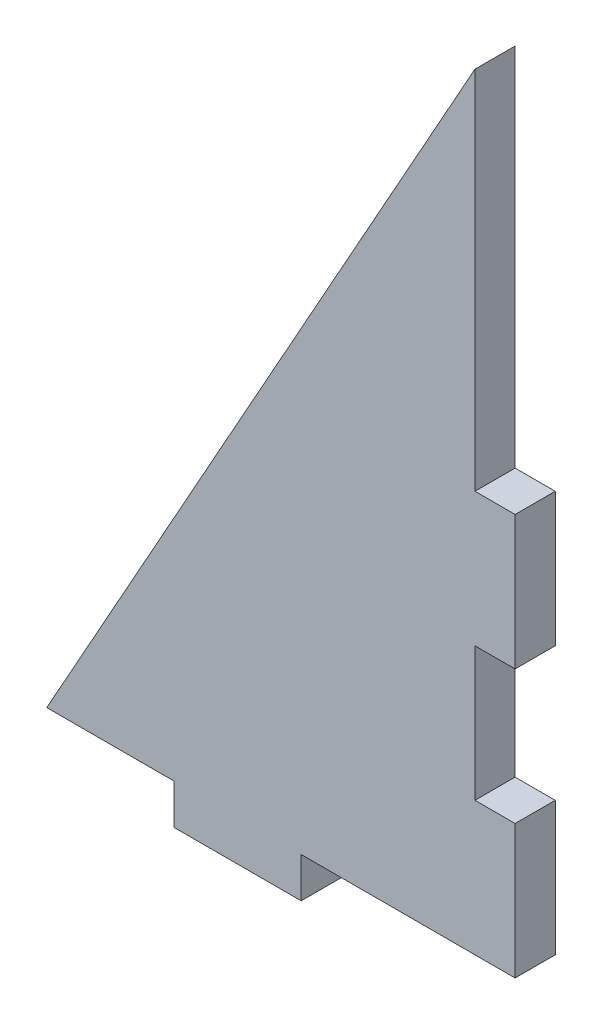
ISO-10303-21;
HEADER;
FILE_DESCRIPTION(('STEP AP214'),'2;1');
FILE_NAME('part.step','',(''),(''),'','','');
FILE_SCHEMA(('AUTOMOTIVE_DESIGN { 1 0 10303 214 1 1 1 1 }'));
ENDSEC;
DATA;
#1=APPLICATION_CONTEXT('core data for automotive mechanical design processes');
#2=APPLICATION_PROTOCOL_DEFINITION('international standard','automotive_design',2000,#1);
#3=PRODUCT_CONTEXT('',#1,'mechanical');
#4=PRODUCT('Part','Part','',(#3));
#5=PRODUCT_RELATED_PRODUCT_CATEGORY('part','',(#4));
#6=PRODUCT_DEFINITION_FORMATION('','',#4);
#7=PRODUCT_DEFINITION_CONTEXT('part definition',#1,'design');
#8=PRODUCT_DEFINITION('design','',#6,#7);
#9=PRODUCT_DEFINITION_SHAPE('','',#8);
#10=(LENGTH_UNIT() NAMED_UNIT(*) SI_UNIT(.MILLI.,.METRE.));
#11=(NAMED_UNIT(*) PLANE_ANGLE_UNIT() SI_UNIT($,.RADIAN.));
#12=(NAMED_UNIT(*) SI_UNIT($,.STERADIAN.) SOLID_ANGLE_UNIT());
#13=UNCERTAINTY_MEASURE_WITH_UNIT(LENGTH_MEASURE(1.E-05),#10,'distance_accuracy_value','');
#14=(GEOMETRIC_REPRESENTATION_CONTEXT(3) GLOBAL_UNCERTAINTY_ASSIGNED_CONTEXT((#13)) GLOBAL_UNIT_ASSIGNED_CONTEXT((#10,
#11,#12)) REPRESENTATION_CONTEXT('',''));
#15=CARTESIAN_POINT('',(0.,0.,0.));
#16=DIRECTION('',(0.,0.,1.));
#17=DIRECTION('',(1.,0.,0.));
#18=AXIS2_PLACEMENT_3D('',#15,#16,#17);
#19=CARTESIAN_POINT('',(0.,40.3163641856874,3.));
#20=DIRECTION('',(0.873136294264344,-0.487476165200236,0.));
#21=DIRECTION('',(0.487476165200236,0.873136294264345,0.));
#22=AXIS2_PLACEMENT_3D('',#19,#20,#21);
#23=PLANE('',#22);
#24=DIRECTION('',(-0.487476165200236,-0.873136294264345,0.));
#25=VECTOR('',#24,1.);
#26=CARTESIAN_POINT('',(0.,40.3163641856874,0.));
#27=LINE('',#26,#25);
#28=CARTESIAN_POINT('',(0.,40.3163641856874,0.));
#29=VERTEX_POINT('',#28);
#30=CARTESIAN_POINT('',(-32.,-17.,0.));
#31=VERTEX_POINT('',#30);
#32=EDGE_CURVE('E159',#29,#31,#27,.T.);
#33=ORIENTED_EDGE('',*,*,#32,.T.);
#34=DIRECTION('',(0.,0.,-1.));
#35=VECTOR('',#34,1.);
#36=CARTESIAN_POINT('',(-32.,-17.,3.));
#37=LINE('',#36,#35);
#38=CARTESIAN_POINT('',(-32.,-17.,3.));
#39=VERTEX_POINT('',#38);
#40=EDGE_CURVE('E11',#39,#31,#37,.T.);
#41=ORIENTED_EDGE('',*,*,#40,.F.);
#42=DIRECTION('',(-0.487476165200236,-0.873136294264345,0.));
#43=VECTOR('',#42,1.);
#44=CARTESIAN_POINT('',(0.,40.3163641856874,3.));
#45=LINE('',#44,#43);
#46=CARTESIAN_POINT('',(0.,40.3163641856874,3.));
#47=VERTEX_POINT('',#46);
#48=EDGE_CURVE('E184',#47,#39,#45,.T.);
#49=ORIENTED_EDGE('',*,*,#48,.F.);
#50=DIRECTION('',(0.,0.,-1.));
#51=VECTOR('',#50,1.);
#52=CARTESIAN_POINT('',(0.,40.3163641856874,3.));
#53=LINE('',#52,#51);
#54=EDGE_CURVE('E155',#47,#29,#53,.T.);
#55=ORIENTED_EDGE('',*,*,#54,.T.);
#56=EDGE_LOOP('',(#33,#41,#49,#55));
#57=FACE_BOUND('',#56,.T.);
#58=ADVANCED_FACE('F33',(#57),#23,.F.);
#59=CARTESIAN_POINT('',(-32.,-17.,3.));
#60=DIRECTION('',(0.,1.,0.));
#61=DIRECTION('',(0.,0.,1.));
#62=AXIS2_PLACEMENT_3D('',#59,#60,#61);
#63=PLANE('',#62);
#64=DIRECTION('',(1.,0.,0.));
#65=VECTOR('',#64,1.);
#66=CARTESIAN_POINT('',(-32.,-17.,0.));
#67=LINE('',#66,#65);
#68=CARTESIAN_POINT('',(-22.4928481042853,-17.,0.));
#69=VERTEX_POINT('',#68);
#70=EDGE_CURVE('E162',#31,#69,#67,.T.);
#71=ORIENTED_EDGE('',*,*,#70,.T.);
#72=DIRECTION('',(0.,0.,-1.));
#73=VECTOR('',#72,1.);
#74=CARTESIAN_POINT('',(-22.4928481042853,-17.,3.));
#75=LINE('',#74,#73);
#76=CARTESIAN_POINT('',(-22.4928481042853,-17.,3.));
#77=VERTEX_POINT('',#76);
#78=EDGE_CURVE('E41',#77,#69,#75,.T.);
#79=ORIENTED_EDGE('',*,*,#78,.F.);
#80=DIRECTION('',(1.,0.,0.));
#81=VECTOR('',#80,1.);
#82=CARTESIAN_POINT('',(-32.,-17.,3.));
#83=LINE('',#82,#81);
#84=EDGE_CURVE('E107',#39,#77,#83,.T.);
#85=ORIENTED_EDGE('',*,*,#84,.F.);
#86=ORIENTED_EDGE('',*,*,#40,.T.);
#87=EDGE_LOOP('',(#71,#79,#85,#86));
#88=FACE_BOUND('',#87,.T.);
#89=ADVANCED_FACE('F266',(#88),#63,.F.);
#90=CARTESIAN_POINT('',(-22.4928481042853,-17.,3.));
#91=DIRECTION('',(1.,0.,0.));
#92=DIRECTION('',(0.,0.,-1.));
#93=AXIS2_PLACEMENT_3D('',#90,#91,#92);
#94=PLANE('',#93);
#95=DIRECTION('',(0.,-1.,0.));
#96=VECTOR('',#95,1.);
#97=CARTESIAN_POINT('',(-22.4928481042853,-17.,0.));
#98=LINE('',#97,#96);
#99=CARTESIAN_POINT('',(-22.4928481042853,-20.,0.));
#100=VERTEX_POINT('',#99);
#101=EDGE_CURVE('E164',#69,#100,#98,.T.);
#102=ORIENTED_EDGE('',*,*,#101,.T.);
#103=DIRECTION('',(0.,0.,-1.));
#104=VECTOR('',#103,1.);
#105=CARTESIAN_POINT('',(-22.4928481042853,-20.,3.));
#106=LINE('',#105,#104);
#107=CARTESIAN_POINT('',(-22.4928481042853,-20.,3.));
#108=VERTEX_POINT('',#107);
#109=EDGE_CURVE('E206',#108,#100,#106,.T.);
#110=ORIENTED_EDGE('',*,*,#109,.F.);
#111=DIRECTION('',(0.,-1.,0.));
#112=VECTOR('',#111,1.);
#113=CARTESIAN_POINT('',(-22.4928481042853,-17.,3.));
#114=LINE('',#113,#112);
#115=EDGE_CURVE('E214',#77,#108,#114,.T.);
#116=ORIENTED_EDGE('',*,*,#115,.F.);
#117=ORIENTED_EDGE('',*,*,#78,.T.);
#118=EDGE_LOOP('',(#102,#110,#116,#117));
#119=FACE_BOUND('',#118,.T.);
#120=ADVANCED_FACE('F212',(#119),#94,.F.);
#121=CARTESIAN_POINT('',(-22.4928481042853,-20.,3.));
#122=DIRECTION('',(0.,1.,0.));
#123=DIRECTION('',(0.,0.,1.));
#124=AXIS2_PLACEMENT_3D('',#121,#122,#123);
#125=PLANE('',#124);
#126=DIRECTION('',(1.,0.,0.));
#127=VECTOR('',#126,1.);
#128=CARTESIAN_POINT('',(-22.4928481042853,-20.,0.));
#129=LINE('',#128,#127);
#130=CARTESIAN_POINT('',(-12.9860055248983,-20.,0.));
#131=VERTEX_POINT('',#130);
#132=EDGE_CURVE('E166',#100,#131,#129,.T.);
#133=ORIENTED_EDGE('',*,*,#132,.T.);
#134=DIRECTION('',(0.,0.,-1.));
#135=VECTOR('',#134,1.);
#136=CARTESIAN_POINT('',(-12.9860055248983,-20.,3.));
#137=LINE('',#136,#135);
#138=CARTESIAN_POINT('',(-12.9860055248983,-20.,3.));
#139=VERTEX_POINT('',#138);
#140=EDGE_CURVE('E203',#139,#131,#137,.T.);
#141=ORIENTED_EDGE('',*,*,#140,.F.);
#142=DIRECTION('',(1.,0.,0.));
#143=VECTOR('',#142,1.);
#144=CARTESIAN_POINT('',(-22.4928481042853,-20.,3.));
#145=LINE('',#144,#143);
#146=EDGE_CURVE('E231',#108,#139,#145,.T.);
#147=ORIENTED_EDGE('',*,*,#146,.F.);
#148=ORIENTED_EDGE('',*,*,#109,.T.);
#149=EDGE_LOOP('',(#133,#141,#147,#148));
#150=FACE_BOUND('',#149,.T.);
#151=ADVANCED_FACE('F222',(#150),#125,.F.);
#152=CARTESIAN_POINT('',(-12.9860055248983,-20.,3.));
#153=DIRECTION('',(-1.,0.,0.));
#154=DIRECTION('',(0.,0.,1.));
#155=AXIS2_PLACEMENT_3D('',#152,#153,#154);
#156=PLANE('',#155);
#157=DIRECTION('',(0.,1.,0.));
#158=VECTOR('',#157,1.);
#159=CARTESIAN_POINT('',(-12.9860055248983,-20.,0.));
#160=LINE('',#159,#158);
#161=CARTESIAN_POINT('',(-12.9860055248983,-17.,0.));
#162=VERTEX_POINT('',#161);
#163=EDGE_CURVE('E168',#131,#162,#160,.T.);
#164=ORIENTED_EDGE('',*,*,#163,.T.);
#165=DIRECTION('',(0.,0.,-1.));
#166=VECTOR('',#165,1.);
#167=CARTESIAN_POINT('',(-12.9860055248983,-17.,3.));
#168=LINE('',#167,#166);
#169=CARTESIAN_POINT('',(-12.9860055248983,-17.,3.));
#170=VERTEX_POINT('',#169);
#171=EDGE_CURVE('E200',#170,#162,#168,.T.);
#172=ORIENTED_EDGE('',*,*,#171,.F.);
#173=DIRECTION('',(0.,1.,0.));
#174=VECTOR('',#173,1.);
#175=CARTESIAN_POINT('',(-12.9860055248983,-20.,3.));
#176=LINE('',#175,#174);
#177=EDGE_CURVE('E228',#139,#170,#176,.T.);
#178=ORIENTED_EDGE('',*,*,#177,.F.);
#179=ORIENTED_EDGE('',*,*,#140,.T.);
#180=EDGE_LOOP('',(#164,#172,#178,#179));
#181=FACE_BOUND('',#180,.T.);
#182=ADVANCED_FACE('F226',(#181),#156,.F.);
#183=CARTESIAN_POINT('',(0.,-17.,3.));
#184=DIRECTION('',(0.,1.,0.));
#185=DIRECTION('',(0.,0.,1.));
#186=AXIS2_PLACEMENT_3D('',#183,#184,#185);
#187=PLANE('',#186);
#188=DIRECTION('',(1.,0.,0.));
#189=VECTOR('',#188,1.);
#190=CARTESIAN_POINT('',(0.,-17.,0.));
#191=LINE('',#190,#189);
#192=CARTESIAN_POINT('',(3.,-17.,0.));
#193=VERTEX_POINT('',#192);
#194=EDGE_CURVE('E171',#162,#193,#191,.T.);
#195=ORIENTED_EDGE('',*,*,#194,.T.);
#196=DIRECTION('',(0.,0.,-1.));
#197=VECTOR('',#196,1.);
#198=CARTESIAN_POINT('',(3.,-17.,3.));
#199=LINE('',#198,#197);
#200=CARTESIAN_POINT('',(3.,-17.,3.));
#201=VERTEX_POINT('',#200);
#202=EDGE_CURVE('E197',#201,#193,#199,.T.);
#203=ORIENTED_EDGE('',*,*,#202,.F.);
#204=DIRECTION('',(1.,0.,0.));
#205=VECTOR('',#204,1.);
#206=CARTESIAN_POINT('',(-12.9860055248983,-17.,3.));
#207=LINE('',#206,#205);
#208=EDGE_CURVE('E230',#170,#201,#207,.T.);
#209=ORIENTED_EDGE('',*,*,#208,.F.);
#210=ORIENTED_EDGE('',*,*,#171,.T.);
#211=EDGE_LOOP('',(#195,#203,#209,#210));
#212=FACE_BOUND('',#211,.T.);
#213=ADVANCED_FACE('F279',(#212),#187,.F.);
#214=CARTESIAN_POINT('',(3.,-17.,3.));
#215=DIRECTION('',(-1.,0.,0.));
#216=DIRECTION('',(0.,0.,1.));
#217=AXIS2_PLACEMENT_3D('',#214,#215,#216);
#218=PLANE('',#217);
#219=DIRECTION('',(0.,1.,0.));
#220=VECTOR('',#219,1.);
#221=CARTESIAN_POINT('',(3.,-17.,0.));
#222=LINE('',#221,#220);
#223=CARTESIAN_POINT('',(3.,-7.00000000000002,0.));
#224=VERTEX_POINT('',#223);
#225=EDGE_CURVE('E173',#193,#224,#222,.T.);
#226=ORIENTED_EDGE('',*,*,#225,.T.);
#227=DIRECTION('',(0.,0.,-1.));
#228=VECTOR('',#227,1.);
#229=CARTESIAN_POINT('',(3.,-7.00000000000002,3.));
#230=LINE('',#229,#228);
#231=CARTESIAN_POINT('',(3.,-7.00000000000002,3.));
#232=VERTEX_POINT('',#231);
#233=EDGE_CURVE('E194',#232,#224,#230,.T.);
#234=ORIENTED_EDGE('',*,*,#233,.F.);
#235=DIRECTION('',(0.,1.,0.));
#236=VECTOR('',#235,1.);
#237=CARTESIAN_POINT('',(3.,-17.,3.));
#238=LINE('',#237,#236);
#239=EDGE_CURVE('E233',#201,#232,#238,.T.);
#240=ORIENTED_EDGE('',*,*,#239,.F.);
#241=ORIENTED_EDGE('',*,*,#202,.T.);
#242=EDGE_LOOP('',(#226,#234,#240,#241));
#243=FACE_BOUND('',#242,.T.);
#244=ADVANCED_FACE('F282',(#243),#218,.F.);
#245=CARTESIAN_POINT('',(3.,-7.00000000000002,3.));
#246=DIRECTION('',(0.,-1.,0.));
#247=DIRECTION('',(0.,0.,-1.));
#248=AXIS2_PLACEMENT_3D('',#245,#246,#247);
#249=PLANE('',#248);
#250=DIRECTION('',(-1.,0.,0.));
#251=VECTOR('',#250,1.);
#252=CARTESIAN_POINT('',(3.,-7.00000000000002,0.));
#253=LINE('',#252,#251);
#254=CARTESIAN_POINT('',(0.,-7.00000000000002,0.));
#255=VERTEX_POINT('',#254);
#256=EDGE_CURVE('E175',#224,#255,#253,.T.);
#257=ORIENTED_EDGE('',*,*,#256,.T.);
#258=DIRECTION('',(0.,0.,-1.));
#259=VECTOR('',#258,1.);
#260=CARTESIAN_POINT('',(0.,-7.00000000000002,3.));
#261=LINE('',#260,#259);
#262=CARTESIAN_POINT('',(0.,-7.00000000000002,3.));
#263=VERTEX_POINT('',#262);
#264=EDGE_CURVE('E191',#263,#255,#261,.T.);
#265=ORIENTED_EDGE('',*,*,#264,.F.);
#266=DIRECTION('',(-1.,0.,0.));
#267=VECTOR('',#266,1.);
#268=CARTESIAN_POINT('',(3.,-7.00000000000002,3.));
#269=LINE('',#268,#267);
#270=EDGE_CURVE('E239',#232,#263,#269,.T.);
#271=ORIENTED_EDGE('',*,*,#270,.F.);
#272=ORIENTED_EDGE('',*,*,#233,.T.);
#273=EDGE_LOOP('',(#257,#265,#271,#272));
#274=FACE_BOUND('',#273,.T.);
#275=ADVANCED_FACE('F286',(#274),#249,.F.);
#276=CARTESIAN_POINT('',(0.,-7.00000000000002,3.));
#277=DIRECTION('',(-1.,0.,0.));
#278=DIRECTION('',(0.,0.,1.));
#279=AXIS2_PLACEMENT_3D('',#276,#277,#278);
#280=PLANE('',#279);
#281=DIRECTION('',(0.,1.,0.));
#282=VECTOR('',#281,1.);
#283=CARTESIAN_POINT('',(0.,-7.00000000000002,0.));
#284=LINE('',#283,#282);
#285=CARTESIAN_POINT('',(0.,2.99999999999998,0.));
#286=VERTEX_POINT('',#285);
#287=EDGE_CURVE('E177',#255,#286,#284,.T.);
#288=ORIENTED_EDGE('',*,*,#287,.T.);
#289=DIRECTION('',(0.,0.,-1.));
#290=VECTOR('',#289,1.);
#291=CARTESIAN_POINT('',(0.,2.99999999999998,3.));
#292=LINE('',#291,#290);
#293=CARTESIAN_POINT('',(0.,2.99999999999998,3.));
#294=VERTEX_POINT('',#293);
#295=EDGE_CURVE('E188',#294,#286,#292,.T.);
#296=ORIENTED_EDGE('',*,*,#295,.F.);
#297=DIRECTION('',(0.,1.,0.));
#298=VECTOR('',#297,1.);
#299=CARTESIAN_POINT('',(0.,-7.00000000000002,3.));
#300=LINE('',#299,#298);
#301=EDGE_CURVE('E241',#263,#294,#300,.T.);
#302=ORIENTED_EDGE('',*,*,#301,.F.);
#303=ORIENTED_EDGE('',*,*,#264,.T.);
#304=EDGE_LOOP('',(#288,#296,#302,#303));
#305=FACE_BOUND('',#304,.T.);
#306=ADVANCED_FACE('F247',(#305),#280,.F.);
#307=CARTESIAN_POINT('',(0.,2.99999999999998,3.));
#308=DIRECTION('',(0.,1.,0.));
#309=DIRECTION('',(0.,0.,1.));
#310=AXIS2_PLACEMENT_3D('',#307,#308,#309);
#311=PLANE('',#310);
#312=DIRECTION('',(1.,0.,0.));
#313=VECTOR('',#312,1.);
#314=CARTESIAN_POINT('',(0.,2.99999999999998,0.));
#315=LINE('',#314,#313);
#316=CARTESIAN_POINT('',(3.,2.99999999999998,0.));
#317=VERTEX_POINT('',#316);
#318=EDGE_CURVE('E179',#286,#317,#315,.T.);
#319=ORIENTED_EDGE('',*,*,#318,.T.);
#320=DIRECTION('',(0.,0.,-1.));
#321=VECTOR('',#320,1.);
#322=CARTESIAN_POINT('',(3.,2.99999999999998,3.));
#323=LINE('',#322,#321);
#324=CARTESIAN_POINT('',(3.,2.99999999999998,3.));
#325=VERTEX_POINT('',#324);
#326=EDGE_CURVE('E150',#325,#317,#323,.T.);
#327=ORIENTED_EDGE('',*,*,#326,.F.);
#328=DIRECTION('',(1.,0.,0.));
#329=VECTOR('',#328,1.);
#330=CARTESIAN_POINT('',(0.,2.99999999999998,3.));
#331=LINE('',#330,#329);
#332=EDGE_CURVE('E141',#294,#325,#331,.T.);
#333=ORIENTED_EDGE('',*,*,#332,.F.);
#334=ORIENTED_EDGE('',*,*,#295,.T.);
#335=EDGE_LOOP('',(#319,#327,#333,#334));
#336=FACE_BOUND('',#335,.T.);
#337=ADVANCED_FACE('F251',(#336),#311,.F.);
#338=CARTESIAN_POINT('',(3.,2.99999999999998,3.));
#339=DIRECTION('',(-1.,0.,0.));
#340=DIRECTION('',(0.,0.,1.));
#341=AXIS2_PLACEMENT_3D('',#338,#339,#340);
#342=PLANE('',#341);
#343=DIRECTION('',(0.,1.,0.));
#344=VECTOR('',#343,1.);
#345=CARTESIAN_POINT('',(3.,2.99999999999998,0.));
#346=LINE('',#345,#344);
#347=CARTESIAN_POINT('',(3.,13.,0.));
#348=VERTEX_POINT('',#347);
#349=EDGE_CURVE('E149',#317,#348,#346,.T.);
#350=ORIENTED_EDGE('',*,*,#349,.T.);
#351=DIRECTION('',(0.,0.,-1.));
#352=VECTOR('',#351,1.);
#353=CARTESIAN_POINT('',(3.,13.,3.));
#354=LINE('',#353,#352);
#355=CARTESIAN_POINT('',(3.,13.,3.));
#356=VERTEX_POINT('',#355);
#357=EDGE_CURVE('E146',#356,#348,#354,.T.);
#358=ORIENTED_EDGE('',*,*,#357,.F.);
#359=DIRECTION('',(0.,1.,0.));
#360=VECTOR('',#359,1.);
#361=CARTESIAN_POINT('',(3.,2.99999999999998,3.));
#362=LINE('',#361,#360);
#363=EDGE_CURVE('E135',#325,#356,#362,.T.);
#364=ORIENTED_EDGE('',*,*,#363,.F.);
#365=ORIENTED_EDGE('',*,*,#326,.T.);
#366=EDGE_LOOP('',(#350,#358,#364,#365));
#367=FACE_BOUND('',#366,.T.);
#368=ADVANCED_FACE('F147',(#367),#342,.F.);
#369=CARTESIAN_POINT('',(3.,13.,3.));
#370=DIRECTION('',(0.,-1.,0.));
#371=DIRECTION('',(0.,0.,-1.));
#372=AXIS2_PLACEMENT_3D('',#369,#370,#371);
#373=PLANE('',#372);
#374=DIRECTION('',(-1.,0.,0.));
#375=VECTOR('',#374,1.);
#376=CARTESIAN_POINT('',(3.,13.,0.));
#377=LINE('',#376,#375);
#378=CARTESIAN_POINT('',(0.,13.,0.));
#379=VERTEX_POINT('',#378);
#380=EDGE_CURVE('E93',#348,#379,#377,.T.);
#381=ORIENTED_EDGE('',*,*,#380,.T.);
#382=DIRECTION('',(0.,0.,-1.));
#383=VECTOR('',#382,1.);
#384=CARTESIAN_POINT('',(0.,13.,3.));
#385=LINE('',#384,#383);
#386=CARTESIAN_POINT('',(0.,13.,3.));
#387=VERTEX_POINT('',#386);
#388=EDGE_CURVE('E151',#387,#379,#385,.T.);
#389=ORIENTED_EDGE('',*,*,#388,.F.);
#390=DIRECTION('',(-1.,0.,0.));
#391=VECTOR('',#390,1.);
#392=CARTESIAN_POINT('',(3.,13.,3.));
#393=LINE('',#392,#391);
#394=EDGE_CURVE('E139',#356,#387,#393,.T.);
#395=ORIENTED_EDGE('',*,*,#394,.F.);
#396=ORIENTED_EDGE('',*,*,#357,.T.);
#397=EDGE_LOOP('',(#381,#389,#395,#396));
#398=FACE_BOUND('',#397,.T.);
#399=ADVANCED_FACE('F153',(#398),#373,.F.);
#400=CARTESIAN_POINT('',(0.,13.,3.));
#401=DIRECTION('',(-1.,0.,0.));
#402=DIRECTION('',(0.,0.,1.));
#403=AXIS2_PLACEMENT_3D('',#400,#401,#402);
#404=PLANE('',#403);
#405=DIRECTION('',(0.,1.,0.));
#406=VECTOR('',#405,1.);
#407=CARTESIAN_POINT('',(0.,13.,0.));
#408=LINE('',#407,#406);
#409=EDGE_CURVE('E99',#379,#29,#408,.T.);
#410=ORIENTED_EDGE('',*,*,#409,.T.);
#411=ORIENTED_EDGE('',*,*,#54,.F.);
#412=DIRECTION('',(0.,1.,0.));
#413=VECTOR('',#412,1.);
#414=CARTESIAN_POINT('',(0.,13.,3.));
#415=LINE('',#414,#413);
#416=EDGE_CURVE('E49',#387,#47,#415,.T.);
#417=ORIENTED_EDGE('',*,*,#416,.F.);
#418=ORIENTED_EDGE('',*,*,#388,.T.);
#419=EDGE_LOOP('',(#410,#411,#417,#418));
#420=FACE_BOUND('',#419,.T.);
#421=ADVANCED_FACE('F255',(#420),#404,.F.);
#422=CARTESIAN_POINT('',(0.,0.,3.));
#423=DIRECTION('',(0.,0.,1.));
#424=DIRECTION('',(1.,0.,0.));
#425=AXIS2_PLACEMENT_3D('',#422,#423,#424);
#426=PLANE('',#425);
#427=ORIENTED_EDGE('',*,*,#48,.T.);
#428=ORIENTED_EDGE('',*,*,#84,.T.);
#429=ORIENTED_EDGE('',*,*,#115,.T.);
#430=ORIENTED_EDGE('',*,*,#146,.T.);
#431=ORIENTED_EDGE('',*,*,#177,.T.);
#432=ORIENTED_EDGE('',*,*,#208,.T.);
#433=ORIENTED_EDGE('',*,*,#239,.T.);
#434=ORIENTED_EDGE('',*,*,#270,.T.);
#435=ORIENTED_EDGE('',*,*,#301,.T.);
#436=ORIENTED_EDGE('',*,*,#332,.T.);
#437=ORIENTED_EDGE('',*,*,#363,.T.);
#438=ORIENTED_EDGE('',*,*,#394,.T.);
#439=ORIENTED_EDGE('',*,*,#416,.T.);
#440=EDGE_LOOP('',(#427,#428,#429,#430,#431,#432,#433,#434,#435,#436,#437,#438,#439));
#441=FACE_BOUND('',#440,.T.);
#442=ADVANCED_FACE('F137',(#441),#426,.T.);
#443=CARTESIAN_POINT('',(0.,0.,0.));
#444=DIRECTION('',(0.,0.,1.));
#445=DIRECTION('',(1.,0.,0.));
#446=AXIS2_PLACEMENT_3D('',#443,#444,#445);
#447=PLANE('',#446);
#448=ORIENTED_EDGE('',*,*,#32,.F.);
#449=ORIENTED_EDGE('',*,*,#409,.F.);
#450=ORIENTED_EDGE('',*,*,#380,.F.);
#451=ORIENTED_EDGE('',*,*,#349,.F.);
#452=ORIENTED_EDGE('',*,*,#318,.F.);
#453=ORIENTED_EDGE('',*,*,#287,.F.);
#454=ORIENTED_EDGE('',*,*,#256,.F.);
#455=ORIENTED_EDGE('',*,*,#225,.F.);
#456=ORIENTED_EDGE('',*,*,#194,.F.);
#457=ORIENTED_EDGE('',*,*,#163,.F.);
#458=ORIENTED_EDGE('',*,*,#132,.F.);
#459=ORIENTED_EDGE('',*,*,#101,.F.);
#460=ORIENTED_EDGE('',*,*,#70,.F.);
#461=EDGE_LOOP('',(#448,#449,#450,#451,#452,#453,#454,#455,#456,#457,#458,#459,#460));
#462=FACE_BOUND('',#461,.T.);
#463=ADVANCED_FACE('F218',(#462),#447,.F.);
#464=CLOSED_SHELL('',(#58,#89,#120,#151,#182,#213,#244,#275,#306,#337,#368,#399,#421,#442,#463));
#465=MANIFOLD_SOLID_BREP('B2',#464);
#466=ADVANCED_BREP_SHAPE_REPRESENTATION('',(#18,#465),#14);
#467=SHAPE_DEFINITION_REPRESENTATION(#9,#466);
ENDSEC;
END-ISO-10303-21;
